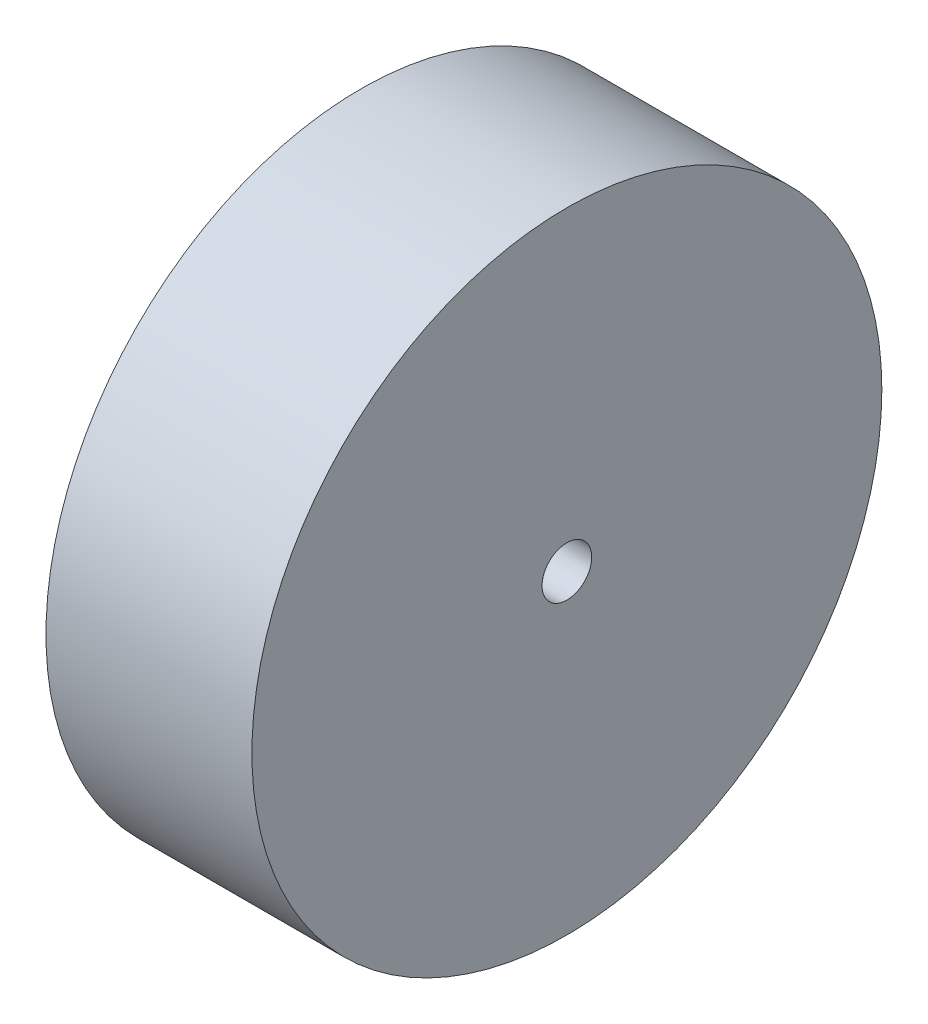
ISO-10303-21;
HEADER;
FILE_DESCRIPTION(('STEP AP214'),'2;1');
FILE_NAME('part.step','',(''),(''),'','','');
FILE_SCHEMA(('AUTOMOTIVE_DESIGN { 1 0 10303 214 1 1 1 1 }'));
ENDSEC;
DATA;
#1=APPLICATION_CONTEXT('core data for automotive mechanical design processes');
#2=APPLICATION_PROTOCOL_DEFINITION('international standard','automotive_design',2000,#1);
#3=PRODUCT_CONTEXT('',#1,'mechanical');
#4=PRODUCT('Part','Part','',(#3));
#5=PRODUCT_RELATED_PRODUCT_CATEGORY('part','',(#4));
#6=PRODUCT_DEFINITION_FORMATION('','',#4);
#7=PRODUCT_DEFINITION_CONTEXT('part definition',#1,'design');
#8=PRODUCT_DEFINITION('design','',#6,#7);
#9=PRODUCT_DEFINITION_SHAPE('','',#8);
#10=(LENGTH_UNIT() NAMED_UNIT(*) SI_UNIT(.MILLI.,.METRE.));
#11=(NAMED_UNIT(*) PLANE_ANGLE_UNIT() SI_UNIT($,.RADIAN.));
#12=(NAMED_UNIT(*) SI_UNIT($,.STERADIAN.) SOLID_ANGLE_UNIT());
#13=UNCERTAINTY_MEASURE_WITH_UNIT(LENGTH_MEASURE(1.E-05),#10,'distance_accuracy_value','');
#14=(GEOMETRIC_REPRESENTATION_CONTEXT(3) GLOBAL_UNCERTAINTY_ASSIGNED_CONTEXT((#13)) GLOBAL_UNIT_ASSIGNED_CONTEXT((#10,
#11,#12)) REPRESENTATION_CONTEXT('',''));
#15=CARTESIAN_POINT('',(0.,0.,0.));
#16=DIRECTION('',(0.,0.,1.));
#17=DIRECTION('',(1.,0.,0.));
#18=AXIS2_PLACEMENT_3D('',#15,#16,#17);
#19=CARTESIAN_POINT('',(8.5,0.,0.));
#20=DIRECTION('',(1.,0.,0.));
#21=DIRECTION('',(0.,0.,-1.));
#22=AXIS2_PLACEMENT_3D('',#19,#20,#21);
#23=PLANE('',#22);
#24=CARTESIAN_POINT('',(8.5,0.,0.));
#25=DIRECTION('',(1.,0.,0.));
#26=DIRECTION('',(0.,0.,-1.));
#27=AXIS2_PLACEMENT_3D('',#24,#25,#26);
#28=CIRCLE('',#27,26.);
#29=CARTESIAN_POINT('',(8.5,0.,-26.));
#30=VERTEX_POINT('',#29);
#31=EDGE_CURVE('E10',#30,#30,#28,.T.);
#32=ORIENTED_EDGE('',*,*,#31,.T.);
#33=EDGE_LOOP('',(#32));
#34=FACE_BOUND('',#33,.T.);
#35=CARTESIAN_POINT('',(8.5,0.,0.));
#36=DIRECTION('',(1.,0.,0.));
#37=DIRECTION('',(0.,0.,-1.));
#38=AXIS2_PLACEMENT_3D('',#35,#36,#37);
#39=CIRCLE('',#38,2.05);
#40=CARTESIAN_POINT('',(8.5,0.,-2.05));
#41=VERTEX_POINT('',#40);
#42=EDGE_CURVE('E59',#41,#41,#39,.T.);
#43=ORIENTED_EDGE('',*,*,#42,.F.);
#44=EDGE_LOOP('',(#43));
#45=FACE_BOUND('',#44,.T.);
#46=ADVANCED_FACE('F45',(#34,#45),#23,.T.);
#47=CARTESIAN_POINT('',(-8.5,0.,0.));
#48=DIRECTION('',(1.,0.,0.));
#49=DIRECTION('',(0.,0.,-1.));
#50=AXIS2_PLACEMENT_3D('',#47,#48,#49);
#51=PLANE('',#50);
#52=CARTESIAN_POINT('',(-8.5,0.,0.));
#53=DIRECTION('',(1.,0.,0.));
#54=DIRECTION('',(0.,0.,-1.));
#55=AXIS2_PLACEMENT_3D('',#52,#53,#54);
#56=CIRCLE('',#55,26.);
#57=CARTESIAN_POINT('',(-8.5,0.,-26.));
#58=VERTEX_POINT('',#57);
#59=EDGE_CURVE('E49',#58,#58,#56,.T.);
#60=ORIENTED_EDGE('',*,*,#59,.F.);
#61=EDGE_LOOP('',(#60));
#62=FACE_BOUND('',#61,.T.);
#63=CARTESIAN_POINT('',(-8.5,0.,0.));
#64=DIRECTION('',(1.,0.,0.));
#65=DIRECTION('',(0.,0.,-1.));
#66=AXIS2_PLACEMENT_3D('',#63,#64,#65);
#67=CIRCLE('',#66,2.05);
#68=CARTESIAN_POINT('',(-8.5,0.,-2.05));
#69=VERTEX_POINT('',#68);
#70=EDGE_CURVE('E61',#69,#69,#67,.T.);
#71=ORIENTED_EDGE('',*,*,#70,.T.);
#72=EDGE_LOOP('',(#71));
#73=FACE_BOUND('',#72,.T.);
#74=ADVANCED_FACE('F74',(#62,#73),#51,.F.);
#75=CARTESIAN_POINT('',(8.5,0.,0.));
#76=DIRECTION('',(-1.,0.,0.));
#77=DIRECTION('',(0.,0.,1.));
#78=AXIS2_PLACEMENT_3D('',#75,#76,#77);
#79=CYLINDRICAL_SURFACE('',#78,26.);
#80=ORIENTED_EDGE('',*,*,#31,.F.);
#81=EDGE_LOOP('',(#80));
#82=FACE_BOUND('',#81,.T.);
#83=ORIENTED_EDGE('',*,*,#59,.T.);
#84=EDGE_LOOP('',(#83));
#85=FACE_BOUND('',#84,.T.);
#86=ADVANCED_FACE('F47',(#82,#85),#79,.T.);
#87=CARTESIAN_POINT('',(8.5,0.,0.));
#88=DIRECTION('',(-1.,0.,0.));
#89=DIRECTION('',(0.,0.,1.));
#90=AXIS2_PLACEMENT_3D('',#87,#88,#89);
#91=CYLINDRICAL_SURFACE('',#90,2.05);
#92=ORIENTED_EDGE('',*,*,#42,.T.);
#93=EDGE_LOOP('',(#92));
#94=FACE_BOUND('',#93,.T.);
#95=ORIENTED_EDGE('',*,*,#70,.F.);
#96=EDGE_LOOP('',(#95));
#97=FACE_BOUND('',#96,.T.);
#98=ADVANCED_FACE('F70',(#94,#97),#91,.F.);
#99=CLOSED_SHELL('',(#46,#74,#86,#98));
#100=MANIFOLD_SOLID_BREP('B2',#99);
#101=ADVANCED_BREP_SHAPE_REPRESENTATION('',(#18,#100),#14);
#102=SHAPE_DEFINITION_REPRESENTATION(#9,#101);
ENDSEC;
END-ISO-10303-21;
